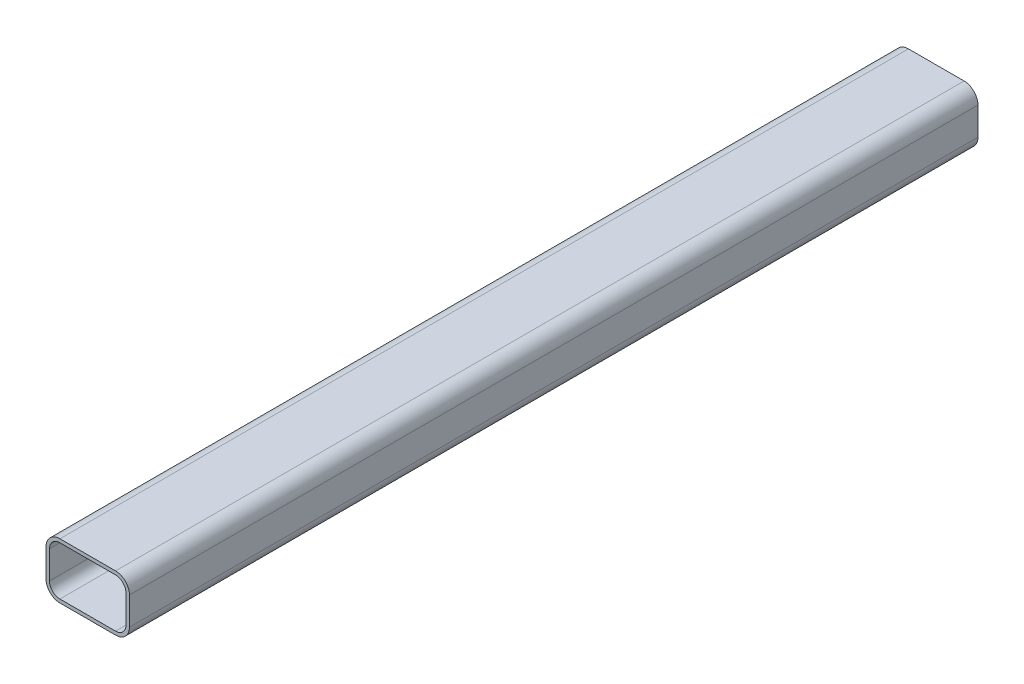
ISO-10303-21;
HEADER;
FILE_DESCRIPTION(('STEP AP214'),'2;1');
FILE_NAME('part.step','',(''),(''),'','','');
FILE_SCHEMA(('AUTOMOTIVE_DESIGN { 1 0 10303 214 1 1 1 1 }'));
ENDSEC;
DATA;
#1=APPLICATION_CONTEXT('core data for automotive mechanical design processes');
#2=APPLICATION_PROTOCOL_DEFINITION('international standard','automotive_design',2000,#1);
#3=PRODUCT_CONTEXT('',#1,'mechanical');
#4=PRODUCT('Part','Part','',(#3));
#5=PRODUCT_RELATED_PRODUCT_CATEGORY('part','',(#4));
#6=PRODUCT_DEFINITION_FORMATION('','',#4);
#7=PRODUCT_DEFINITION_CONTEXT('part definition',#1,'design');
#8=PRODUCT_DEFINITION('design','',#6,#7);
#9=PRODUCT_DEFINITION_SHAPE('','',#8);
#10=(LENGTH_UNIT() NAMED_UNIT(*) SI_UNIT(.MILLI.,.METRE.));
#11=(NAMED_UNIT(*) PLANE_ANGLE_UNIT() SI_UNIT($,.RADIAN.));
#12=(NAMED_UNIT(*) SI_UNIT($,.STERADIAN.) SOLID_ANGLE_UNIT());
#13=UNCERTAINTY_MEASURE_WITH_UNIT(LENGTH_MEASURE(1.E-05),#10,'distance_accuracy_value','');
#14=(GEOMETRIC_REPRESENTATION_CONTEXT(3) GLOBAL_UNCERTAINTY_ASSIGNED_CONTEXT((#13)) GLOBAL_UNIT_ASSIGNED_CONTEXT((#10,
#11,#12)) REPRESENTATION_CONTEXT('',''));
#15=CARTESIAN_POINT('',(0.,0.,0.));
#16=DIRECTION('',(0.,0.,1.));
#17=DIRECTION('',(1.,0.,0.));
#18=AXIS2_PLACEMENT_3D('',#15,#16,#17);
#19=CARTESIAN_POINT('',(-762.00000000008,-165.1,387.35));
#20=DIRECTION('',(0.,0.,1.));
#21=DIRECTION('',(1.,0.,0.));
#22=AXIS2_PLACEMENT_3D('',#19,#20,#21);
#23=PLANE('',#22);
#24=CARTESIAN_POINT('',(-762.00000000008,-165.1,387.35));
#25=DIRECTION('',(0.,0.,1.));
#26=DIRECTION('',(1.,0.,0.));
#27=AXIS2_PLACEMENT_3D('',#24,#25,#26);
#28=CIRCLE('',#27,12.7);
#29=CARTESIAN_POINT('',(-762.00000000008,-177.8,387.35));
#30=VERTEX_POINT('',#29);
#31=CARTESIAN_POINT('',(-749.30000000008,-165.1,387.35));
#32=VERTEX_POINT('',#31);
#33=EDGE_CURVE('E226',#30,#32,#28,.T.);
#34=ORIENTED_EDGE('',*,*,#33,.T.);
#35=DIRECTION('',(0.,-1.,0.));
#36=VECTOR('',#35,1.);
#37=CARTESIAN_POINT('',(-749.300000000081,-139.7,387.35));
#38=LINE('',#37,#36);
#39=CARTESIAN_POINT('',(-749.300000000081,-139.7,387.35));
#40=VERTEX_POINT('',#39);
#41=EDGE_CURVE('E228',#40,#32,#38,.T.);
#42=ORIENTED_EDGE('',*,*,#41,.F.);
#43=CARTESIAN_POINT('',(-762.00000000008,-139.7,387.35));
#44=DIRECTION('',(0.,0.,1.));
#45=DIRECTION('',(1.,0.,0.));
#46=AXIS2_PLACEMENT_3D('',#43,#44,#45);
#47=CIRCLE('',#46,12.7);
#48=CARTESIAN_POINT('',(-762.00000000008,-127.,387.35));
#49=VERTEX_POINT('',#48);
#50=EDGE_CURVE('E231',#40,#49,#47,.T.);
#51=ORIENTED_EDGE('',*,*,#50,.T.);
#52=DIRECTION('',(-1.,0.,0.));
#53=VECTOR('',#52,1.);
#54=CARTESIAN_POINT('',(-762.00000000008,-127.,387.35));
#55=LINE('',#54,#53);
#56=CARTESIAN_POINT('',(-812.80000000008,-127.,387.35));
#57=VERTEX_POINT('',#56);
#58=EDGE_CURVE('E233',#49,#57,#55,.T.);
#59=ORIENTED_EDGE('',*,*,#58,.T.);
#60=CARTESIAN_POINT('',(-812.80000000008,-139.7,387.35));
#61=DIRECTION('',(0.,0.,1.));
#62=DIRECTION('',(1.,0.,0.));
#63=AXIS2_PLACEMENT_3D('',#60,#61,#62);
#64=CIRCLE('',#63,12.7);
#65=CARTESIAN_POINT('',(-825.50000000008,-139.7,387.35));
#66=VERTEX_POINT('',#65);
#67=EDGE_CURVE('E235',#57,#66,#64,.T.);
#68=ORIENTED_EDGE('',*,*,#67,.T.);
#69=DIRECTION('',(0.,1.,0.));
#70=VECTOR('',#69,1.);
#71=CARTESIAN_POINT('',(-825.50000000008,-165.1,387.35));
#72=LINE('',#71,#70);
#73=CARTESIAN_POINT('',(-825.50000000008,-165.1,387.35));
#74=VERTEX_POINT('',#73);
#75=EDGE_CURVE('E237',#74,#66,#72,.T.);
#76=ORIENTED_EDGE('',*,*,#75,.F.);
#77=CARTESIAN_POINT('',(-812.80000000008,-165.1,387.35));
#78=DIRECTION('',(0.,0.,1.));
#79=DIRECTION('',(1.,0.,0.));
#80=AXIS2_PLACEMENT_3D('',#77,#78,#79);
#81=CIRCLE('',#80,12.7);
#82=CARTESIAN_POINT('',(-812.80000000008,-177.8,387.35));
#83=VERTEX_POINT('',#82);
#84=EDGE_CURVE('E240',#74,#83,#81,.T.);
#85=ORIENTED_EDGE('',*,*,#84,.T.);
#86=DIRECTION('',(1.,0.,0.));
#87=VECTOR('',#86,1.);
#88=CARTESIAN_POINT('',(-812.80000000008,-177.8,387.35));
#89=LINE('',#88,#87);
#90=EDGE_CURVE('E242',#83,#30,#89,.T.);
#91=ORIENTED_EDGE('',*,*,#90,.T.);
#92=EDGE_LOOP('',(#34,#42,#51,#59,#68,#76,#85,#91));
#93=FACE_BOUND('',#92,.T.);
#94=DIRECTION('',(0.,-1.,0.));
#95=VECTOR('',#94,1.);
#96=CARTESIAN_POINT('',(-752.475000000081,-139.7,387.35));
#97=LINE('',#96,#95);
#98=CARTESIAN_POINT('',(-752.475000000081,-139.7,387.35));
#99=VERTEX_POINT('',#98);
#100=CARTESIAN_POINT('',(-752.475000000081,-165.1,387.35));
#101=VERTEX_POINT('',#100);
#102=EDGE_CURVE('E180',#99,#101,#97,.T.);
#103=ORIENTED_EDGE('',*,*,#102,.T.);
#104=CARTESIAN_POINT('',(-762.00000000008,-165.1,387.35));
#105=DIRECTION('',(0.,0.,1.));
#106=DIRECTION('',(1.,0.,0.));
#107=AXIS2_PLACEMENT_3D('',#104,#105,#106);
#108=CIRCLE('',#107,9.52500000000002);
#109=CARTESIAN_POINT('',(-762.00000000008,-174.625,387.35));
#110=VERTEX_POINT('',#109);
#111=EDGE_CURVE('E145',#110,#101,#108,.T.);
#112=ORIENTED_EDGE('',*,*,#111,.F.);
#113=DIRECTION('',(1.,0.,0.));
#114=VECTOR('',#113,1.);
#115=CARTESIAN_POINT('',(-812.80000000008,-174.625,387.35));
#116=LINE('',#115,#114);
#117=CARTESIAN_POINT('',(-812.80000000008,-174.625,387.35));
#118=VERTEX_POINT('',#117);
#119=EDGE_CURVE('E193',#118,#110,#116,.T.);
#120=ORIENTED_EDGE('',*,*,#119,.F.);
#121=CARTESIAN_POINT('',(-812.80000000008,-165.1,387.35));
#122=DIRECTION('',(0.,0.,1.));
#123=DIRECTION('',(1.,0.,0.));
#124=AXIS2_PLACEMENT_3D('',#121,#122,#123);
#125=CIRCLE('',#124,9.52499999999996);
#126=CARTESIAN_POINT('',(-822.32500000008,-165.1,387.35));
#127=VERTEX_POINT('',#126);
#128=EDGE_CURVE('E191',#127,#118,#125,.T.);
#129=ORIENTED_EDGE('',*,*,#128,.F.);
#130=DIRECTION('',(0.,1.,0.));
#131=VECTOR('',#130,1.);
#132=CARTESIAN_POINT('',(-822.32500000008,-165.1,387.35));
#133=LINE('',#132,#131);
#134=CARTESIAN_POINT('',(-822.32500000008,-139.7,387.35));
#135=VERTEX_POINT('',#134);
#136=EDGE_CURVE('E188',#127,#135,#133,.T.);
#137=ORIENTED_EDGE('',*,*,#136,.T.);
#138=CARTESIAN_POINT('',(-812.80000000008,-139.7,387.35));
#139=DIRECTION('',(0.,0.,1.));
#140=DIRECTION('',(1.,0.,0.));
#141=AXIS2_PLACEMENT_3D('',#138,#139,#140);
#142=CIRCLE('',#141,9.52500000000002);
#143=CARTESIAN_POINT('',(-812.80000000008,-130.175,387.35));
#144=VERTEX_POINT('',#143);
#145=EDGE_CURVE('E186',#144,#135,#142,.T.);
#146=ORIENTED_EDGE('',*,*,#145,.F.);
#147=DIRECTION('',(-1.,0.,0.));
#148=VECTOR('',#147,1.);
#149=CARTESIAN_POINT('',(-762.00000000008,-130.175,387.35));
#150=LINE('',#149,#148);
#151=CARTESIAN_POINT('',(-762.00000000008,-130.175,387.35));
#152=VERTEX_POINT('',#151);
#153=EDGE_CURVE('E184',#152,#144,#150,.T.);
#154=ORIENTED_EDGE('',*,*,#153,.F.);
#155=CARTESIAN_POINT('',(-762.00000000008,-139.7,387.35));
#156=DIRECTION('',(0.,0.,1.));
#157=DIRECTION('',(1.,0.,0.));
#158=AXIS2_PLACEMENT_3D('',#155,#156,#157);
#159=CIRCLE('',#158,9.52500000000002);
#160=EDGE_CURVE('E182',#99,#152,#159,.T.);
#161=ORIENTED_EDGE('',*,*,#160,.F.);
#162=EDGE_LOOP('',(#103,#112,#120,#129,#137,#146,#154,#161));
#163=FACE_BOUND('',#162,.T.);
#164=ADVANCED_FACE('F30',(#93,#163),#23,.T.);
#165=CARTESIAN_POINT('',(-762.00000000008,-165.1,-387.35));
#166=DIRECTION('',(0.,0.,1.));
#167=DIRECTION('',(1.,0.,0.));
#168=AXIS2_PLACEMENT_3D('',#165,#166,#167);
#169=PLANE('',#168);
#170=CARTESIAN_POINT('',(-762.00000000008,-165.1,-387.35));
#171=DIRECTION('',(0.,0.,1.));
#172=DIRECTION('',(1.,0.,0.));
#173=AXIS2_PLACEMENT_3D('',#170,#171,#172);
#174=CIRCLE('',#173,12.7);
#175=CARTESIAN_POINT('',(-762.00000000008,-177.8,-387.35));
#176=VERTEX_POINT('',#175);
#177=CARTESIAN_POINT('',(-749.30000000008,-165.1,-387.35));
#178=VERTEX_POINT('',#177);
#179=EDGE_CURVE('E149',#176,#178,#174,.T.);
#180=ORIENTED_EDGE('',*,*,#179,.F.);
#181=DIRECTION('',(1.,0.,0.));
#182=VECTOR('',#181,1.);
#183=CARTESIAN_POINT('',(-812.80000000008,-177.8,-387.35));
#184=LINE('',#183,#182);
#185=CARTESIAN_POINT('',(-812.80000000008,-177.8,-387.35));
#186=VERTEX_POINT('',#185);
#187=EDGE_CURVE('E224',#186,#176,#184,.T.);
#188=ORIENTED_EDGE('',*,*,#187,.F.);
#189=CARTESIAN_POINT('',(-812.80000000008,-165.1,-387.35));
#190=DIRECTION('',(0.,0.,1.));
#191=DIRECTION('',(1.,0.,0.));
#192=AXIS2_PLACEMENT_3D('',#189,#190,#191);
#193=CIRCLE('',#192,12.7);
#194=CARTESIAN_POINT('',(-825.50000000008,-165.1,-387.35));
#195=VERTEX_POINT('',#194);
#196=EDGE_CURVE('E222',#195,#186,#193,.T.);
#197=ORIENTED_EDGE('',*,*,#196,.F.);
#198=DIRECTION('',(0.,1.,0.));
#199=VECTOR('',#198,1.);
#200=CARTESIAN_POINT('',(-825.50000000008,-165.1,-387.35));
#201=LINE('',#200,#199);
#202=CARTESIAN_POINT('',(-825.50000000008,-139.7,-387.35));
#203=VERTEX_POINT('',#202);
#204=EDGE_CURVE('E219',#195,#203,#201,.T.);
#205=ORIENTED_EDGE('',*,*,#204,.T.);
#206=CARTESIAN_POINT('',(-812.80000000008,-139.7,-387.35));
#207=DIRECTION('',(0.,0.,1.));
#208=DIRECTION('',(1.,0.,0.));
#209=AXIS2_PLACEMENT_3D('',#206,#207,#208);
#210=CIRCLE('',#209,12.7);
#211=CARTESIAN_POINT('',(-812.80000000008,-127.,-387.35));
#212=VERTEX_POINT('',#211);
#213=EDGE_CURVE('E216',#212,#203,#210,.T.);
#214=ORIENTED_EDGE('',*,*,#213,.F.);
#215=DIRECTION('',(-1.,0.,0.));
#216=VECTOR('',#215,1.);
#217=CARTESIAN_POINT('',(-762.00000000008,-127.,-387.35));
#218=LINE('',#217,#216);
#219=CARTESIAN_POINT('',(-762.00000000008,-127.,-387.35));
#220=VERTEX_POINT('',#219);
#221=EDGE_CURVE('E214',#220,#212,#218,.T.);
#222=ORIENTED_EDGE('',*,*,#221,.F.);
#223=CARTESIAN_POINT('',(-762.00000000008,-139.7,-387.35));
#224=DIRECTION('',(0.,0.,1.));
#225=DIRECTION('',(1.,0.,0.));
#226=AXIS2_PLACEMENT_3D('',#223,#224,#225);
#227=CIRCLE('',#226,12.7);
#228=CARTESIAN_POINT('',(-749.300000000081,-139.7,-387.35));
#229=VERTEX_POINT('',#228);
#230=EDGE_CURVE('E212',#229,#220,#227,.T.);
#231=ORIENTED_EDGE('',*,*,#230,.F.);
#232=DIRECTION('',(0.,-1.,0.));
#233=VECTOR('',#232,1.);
#234=CARTESIAN_POINT('',(-749.300000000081,-139.7,-387.35));
#235=LINE('',#234,#233);
#236=EDGE_CURVE('E209',#229,#178,#235,.T.);
#237=ORIENTED_EDGE('',*,*,#236,.T.);
#238=EDGE_LOOP('',(#180,#188,#197,#205,#214,#222,#231,#237));
#239=FACE_BOUND('',#238,.T.);
#240=CARTESIAN_POINT('',(-762.00000000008,-165.1,-387.35));
#241=DIRECTION('',(0.,0.,1.));
#242=DIRECTION('',(1.,0.,0.));
#243=AXIS2_PLACEMENT_3D('',#240,#241,#242);
#244=CIRCLE('',#243,9.52500000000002);
#245=CARTESIAN_POINT('',(-762.00000000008,-174.625,-387.35));
#246=VERTEX_POINT('',#245);
#247=CARTESIAN_POINT('',(-752.475000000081,-165.1,-387.35));
#248=VERTEX_POINT('',#247);
#249=EDGE_CURVE('E53',#246,#248,#244,.T.);
#250=ORIENTED_EDGE('',*,*,#249,.T.);
#251=DIRECTION('',(0.,-1.,0.));
#252=VECTOR('',#251,1.);
#253=CARTESIAN_POINT('',(-752.475000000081,-139.7,-387.35));
#254=LINE('',#253,#252);
#255=CARTESIAN_POINT('',(-752.475000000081,-139.7,-387.35));
#256=VERTEX_POINT('',#255);
#257=EDGE_CURVE('E153',#256,#248,#254,.T.);
#258=ORIENTED_EDGE('',*,*,#257,.F.);
#259=CARTESIAN_POINT('',(-762.00000000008,-139.7,-387.35));
#260=DIRECTION('',(0.,0.,1.));
#261=DIRECTION('',(1.,0.,0.));
#262=AXIS2_PLACEMENT_3D('',#259,#260,#261);
#263=CIRCLE('',#262,9.52500000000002);
#264=CARTESIAN_POINT('',(-762.00000000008,-130.175,-387.35));
#265=VERTEX_POINT('',#264);
#266=EDGE_CURVE('E158',#256,#265,#263,.T.);
#267=ORIENTED_EDGE('',*,*,#266,.T.);
#268=DIRECTION('',(-1.,0.,0.));
#269=VECTOR('',#268,1.);
#270=CARTESIAN_POINT('',(-762.00000000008,-130.175,-387.35));
#271=LINE('',#270,#269);
#272=CARTESIAN_POINT('',(-812.80000000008,-130.175,-387.35));
#273=VERTEX_POINT('',#272);
#274=EDGE_CURVE('E167',#265,#273,#271,.T.);
#275=ORIENTED_EDGE('',*,*,#274,.T.);
#276=CARTESIAN_POINT('',(-812.80000000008,-139.7,-387.35));
#277=DIRECTION('',(0.,0.,1.));
#278=DIRECTION('',(1.,0.,0.));
#279=AXIS2_PLACEMENT_3D('',#276,#277,#278);
#280=CIRCLE('',#279,9.52500000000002);
#281=CARTESIAN_POINT('',(-822.32500000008,-139.7,-387.35));
#282=VERTEX_POINT('',#281);
#283=EDGE_CURVE('E170',#273,#282,#280,.T.);
#284=ORIENTED_EDGE('',*,*,#283,.T.);
#285=DIRECTION('',(0.,1.,0.));
#286=VECTOR('',#285,1.);
#287=CARTESIAN_POINT('',(-822.32500000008,-165.1,-387.35));
#288=LINE('',#287,#286);
#289=CARTESIAN_POINT('',(-822.32500000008,-165.1,-387.35));
#290=VERTEX_POINT('',#289);
#291=EDGE_CURVE('E173',#290,#282,#288,.T.);
#292=ORIENTED_EDGE('',*,*,#291,.F.);
#293=CARTESIAN_POINT('',(-812.80000000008,-165.1,-387.35));
#294=DIRECTION('',(0.,0.,1.));
#295=DIRECTION('',(1.,0.,0.));
#296=AXIS2_PLACEMENT_3D('',#293,#294,#295);
#297=CIRCLE('',#296,9.52499999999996);
#298=CARTESIAN_POINT('',(-812.80000000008,-174.625,-387.35));
#299=VERTEX_POINT('',#298);
#300=EDGE_CURVE('E176',#290,#299,#297,.T.);
#301=ORIENTED_EDGE('',*,*,#300,.T.);
#302=DIRECTION('',(1.,0.,0.));
#303=VECTOR('',#302,1.);
#304=CARTESIAN_POINT('',(-812.80000000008,-174.625,-387.35));
#305=LINE('',#304,#303);
#306=EDGE_CURVE('E163',#299,#246,#305,.T.);
#307=ORIENTED_EDGE('',*,*,#306,.T.);
#308=EDGE_LOOP('',(#250,#258,#267,#275,#284,#292,#301,#307));
#309=FACE_BOUND('',#308,.T.);
#310=ADVANCED_FACE('F161',(#239,#309),#169,.F.);
#311=CARTESIAN_POINT('',(-762.00000000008,-165.1,387.35));
#312=DIRECTION('',(0.,0.,-1.));
#313=DIRECTION('',(-1.,0.,0.));
#314=AXIS2_PLACEMENT_3D('',#311,#312,#313);
#315=CYLINDRICAL_SURFACE('',#314,12.7);
#316=ORIENTED_EDGE('',*,*,#179,.T.);
#317=DIRECTION('',(0.,0.,-1.));
#318=VECTOR('',#317,1.);
#319=CARTESIAN_POINT('',(-749.30000000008,-165.1,387.35));
#320=LINE('',#319,#318);
#321=EDGE_CURVE('E11',#32,#178,#320,.T.);
#322=ORIENTED_EDGE('',*,*,#321,.F.);
#323=ORIENTED_EDGE('',*,*,#33,.F.);
#324=DIRECTION('',(0.,0.,-1.));
#325=VECTOR('',#324,1.);
#326=CARTESIAN_POINT('',(-762.00000000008,-177.8,387.35));
#327=LINE('',#326,#325);
#328=EDGE_CURVE('E244',#30,#176,#327,.T.);
#329=ORIENTED_EDGE('',*,*,#328,.T.);
#330=EDGE_LOOP('',(#316,#322,#323,#329));
#331=FACE_BOUND('',#330,.T.);
#332=ADVANCED_FACE('F32',(#331),#315,.T.);
#333=CARTESIAN_POINT('',(-749.300000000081,-139.7,387.35));
#334=DIRECTION('',(1.,0.,0.));
#335=DIRECTION('',(0.,1.,0.));
#336=AXIS2_PLACEMENT_3D('',#333,#334,#335);
#337=PLANE('',#336);
#338=ORIENTED_EDGE('',*,*,#236,.F.);
#339=DIRECTION('',(0.,0.,-1.));
#340=VECTOR('',#339,1.);
#341=CARTESIAN_POINT('',(-749.300000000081,-139.7,387.35));
#342=LINE('',#341,#340);
#343=EDGE_CURVE('E38',#40,#229,#342,.T.);
#344=ORIENTED_EDGE('',*,*,#343,.F.);
#345=ORIENTED_EDGE('',*,*,#41,.T.);
#346=ORIENTED_EDGE('',*,*,#321,.T.);
#347=EDGE_LOOP('',(#338,#344,#345,#346));
#348=FACE_BOUND('',#347,.T.);
#349=ADVANCED_FACE('F271',(#348),#337,.T.);
#350=CARTESIAN_POINT('',(-762.00000000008,-139.7,387.35));
#351=DIRECTION('',(0.,0.,-1.));
#352=DIRECTION('',(-1.,0.,0.));
#353=AXIS2_PLACEMENT_3D('',#350,#351,#352);
#354=CYLINDRICAL_SURFACE('',#353,12.7);
#355=ORIENTED_EDGE('',*,*,#230,.T.);
#356=DIRECTION('',(0.,0.,-1.));
#357=VECTOR('',#356,1.);
#358=CARTESIAN_POINT('',(-762.00000000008,-127.,387.35));
#359=LINE('',#358,#357);
#360=EDGE_CURVE('E257',#49,#220,#359,.T.);
#361=ORIENTED_EDGE('',*,*,#360,.F.);
#362=ORIENTED_EDGE('',*,*,#50,.F.);
#363=ORIENTED_EDGE('',*,*,#343,.T.);
#364=EDGE_LOOP('',(#355,#361,#362,#363));
#365=FACE_BOUND('',#364,.T.);
#366=ADVANCED_FACE('F262',(#365),#354,.T.);
#367=CARTESIAN_POINT('',(-762.00000000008,-127.,387.35));
#368=DIRECTION('',(0.,-1.,0.));
#369=DIRECTION('',(0.,0.,-1.));
#370=AXIS2_PLACEMENT_3D('',#367,#368,#369);
#371=PLANE('',#370);
#372=ORIENTED_EDGE('',*,*,#221,.T.);
#373=DIRECTION('',(0.,0.,-1.));
#374=VECTOR('',#373,1.);
#375=CARTESIAN_POINT('',(-812.80000000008,-127.,387.35));
#376=LINE('',#375,#374);
#377=EDGE_CURVE('E254',#57,#212,#376,.T.);
#378=ORIENTED_EDGE('',*,*,#377,.F.);
#379=ORIENTED_EDGE('',*,*,#58,.F.);
#380=ORIENTED_EDGE('',*,*,#360,.T.);
#381=EDGE_LOOP('',(#372,#378,#379,#380));
#382=FACE_BOUND('',#381,.T.);
#383=ADVANCED_FACE('F296',(#382),#371,.F.);
#384=CARTESIAN_POINT('',(-812.80000000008,-139.7,387.35));
#385=DIRECTION('',(0.,0.,-1.));
#386=DIRECTION('',(-1.,0.,0.));
#387=AXIS2_PLACEMENT_3D('',#384,#385,#386);
#388=CYLINDRICAL_SURFACE('',#387,12.7);
#389=ORIENTED_EDGE('',*,*,#213,.T.);
#390=DIRECTION('',(0.,0.,-1.));
#391=VECTOR('',#390,1.);
#392=CARTESIAN_POINT('',(-825.50000000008,-139.7,387.35));
#393=LINE('',#392,#391);
#394=EDGE_CURVE('E252',#66,#203,#393,.T.);
#395=ORIENTED_EDGE('',*,*,#394,.F.);
#396=ORIENTED_EDGE('',*,*,#67,.F.);
#397=ORIENTED_EDGE('',*,*,#377,.T.);
#398=EDGE_LOOP('',(#389,#395,#396,#397));
#399=FACE_BOUND('',#398,.T.);
#400=ADVANCED_FACE('F291',(#399),#388,.T.);
#401=CARTESIAN_POINT('',(-825.50000000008,-165.1,387.35));
#402=DIRECTION('',(-1.,0.,0.));
#403=DIRECTION('',(0.,0.,1.));
#404=AXIS2_PLACEMENT_3D('',#401,#402,#403);
#405=PLANE('',#404);
#406=ORIENTED_EDGE('',*,*,#204,.F.);
#407=DIRECTION('',(0.,0.,-1.));
#408=VECTOR('',#407,1.);
#409=CARTESIAN_POINT('',(-825.50000000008,-165.1,387.35));
#410=LINE('',#409,#408);
#411=EDGE_CURVE('E250',#74,#195,#410,.T.);
#412=ORIENTED_EDGE('',*,*,#411,.F.);
#413=ORIENTED_EDGE('',*,*,#75,.T.);
#414=ORIENTED_EDGE('',*,*,#394,.T.);
#415=EDGE_LOOP('',(#406,#412,#413,#414));
#416=FACE_BOUND('',#415,.T.);
#417=ADVANCED_FACE('F288',(#416),#405,.T.);
#418=CARTESIAN_POINT('',(-812.80000000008,-165.1,387.35));
#419=DIRECTION('',(0.,0.,-1.));
#420=DIRECTION('',(-1.,0.,0.));
#421=AXIS2_PLACEMENT_3D('',#418,#419,#420);
#422=CYLINDRICAL_SURFACE('',#421,12.7);
#423=ORIENTED_EDGE('',*,*,#196,.T.);
#424=DIRECTION('',(0.,0.,-1.));
#425=VECTOR('',#424,1.);
#426=CARTESIAN_POINT('',(-812.80000000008,-177.8,387.35));
#427=LINE('',#426,#425);
#428=EDGE_CURVE('E247',#83,#186,#427,.T.);
#429=ORIENTED_EDGE('',*,*,#428,.F.);
#430=ORIENTED_EDGE('',*,*,#84,.F.);
#431=ORIENTED_EDGE('',*,*,#411,.T.);
#432=EDGE_LOOP('',(#423,#429,#430,#431));
#433=FACE_BOUND('',#432,.T.);
#434=ADVANCED_FACE('F285',(#433),#422,.T.);
#435=CARTESIAN_POINT('',(-812.80000000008,-177.8,387.35));
#436=DIRECTION('',(0.,1.,0.));
#437=DIRECTION('',(0.,0.,1.));
#438=AXIS2_PLACEMENT_3D('',#435,#436,#437);
#439=PLANE('',#438);
#440=ORIENTED_EDGE('',*,*,#187,.T.);
#441=ORIENTED_EDGE('',*,*,#328,.F.);
#442=ORIENTED_EDGE('',*,*,#90,.F.);
#443=ORIENTED_EDGE('',*,*,#428,.T.);
#444=EDGE_LOOP('',(#440,#441,#442,#443));
#445=FACE_BOUND('',#444,.T.);
#446=ADVANCED_FACE('F280',(#445),#439,.F.);
#447=CARTESIAN_POINT('',(-762.00000000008,-165.1,387.35));
#448=DIRECTION('',(0.,0.,-1.));
#449=DIRECTION('',(-1.,0.,0.));
#450=AXIS2_PLACEMENT_3D('',#447,#448,#449);
#451=CYLINDRICAL_SURFACE('',#450,9.52500000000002);
#452=ORIENTED_EDGE('',*,*,#249,.F.);
#453=DIRECTION('',(0.,0.,-1.));
#454=VECTOR('',#453,1.);
#455=CARTESIAN_POINT('',(-762.00000000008,-174.625,387.35));
#456=LINE('',#455,#454);
#457=EDGE_CURVE('E195',#110,#246,#456,.T.);
#458=ORIENTED_EDGE('',*,*,#457,.F.);
#459=ORIENTED_EDGE('',*,*,#111,.T.);
#460=DIRECTION('',(0.,0.,-1.));
#461=VECTOR('',#460,1.);
#462=CARTESIAN_POINT('',(-752.475000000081,-165.1,387.35));
#463=LINE('',#462,#461);
#464=EDGE_CURVE('E141',#101,#248,#463,.T.);
#465=ORIENTED_EDGE('',*,*,#464,.T.);
#466=EDGE_LOOP('',(#452,#458,#459,#465));
#467=FACE_BOUND('',#466,.T.);
#468=ADVANCED_FACE('F143',(#467),#451,.F.);
#469=CARTESIAN_POINT('',(-752.475000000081,-139.7,387.35));
#470=DIRECTION('',(1.,0.,0.));
#471=DIRECTION('',(0.,1.,0.));
#472=AXIS2_PLACEMENT_3D('',#469,#470,#471);
#473=PLANE('',#472);
#474=ORIENTED_EDGE('',*,*,#257,.T.);
#475=ORIENTED_EDGE('',*,*,#464,.F.);
#476=ORIENTED_EDGE('',*,*,#102,.F.);
#477=DIRECTION('',(0.,0.,-1.));
#478=VECTOR('',#477,1.);
#479=CARTESIAN_POINT('',(-752.475000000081,-139.7,387.35));
#480=LINE('',#479,#478);
#481=EDGE_CURVE('E150',#99,#256,#480,.T.);
#482=ORIENTED_EDGE('',*,*,#481,.T.);
#483=EDGE_LOOP('',(#474,#475,#476,#482));
#484=FACE_BOUND('',#483,.T.);
#485=ADVANCED_FACE('F154',(#484),#473,.F.);
#486=CARTESIAN_POINT('',(-762.00000000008,-139.7,387.35));
#487=DIRECTION('',(0.,0.,-1.));
#488=DIRECTION('',(-1.,0.,0.));
#489=AXIS2_PLACEMENT_3D('',#486,#487,#488);
#490=CYLINDRICAL_SURFACE('',#489,9.52500000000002);
#491=ORIENTED_EDGE('',*,*,#266,.F.);
#492=ORIENTED_EDGE('',*,*,#481,.F.);
#493=ORIENTED_EDGE('',*,*,#160,.T.);
#494=DIRECTION('',(0.,0.,-1.));
#495=VECTOR('',#494,1.);
#496=CARTESIAN_POINT('',(-762.00000000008,-130.175,387.35));
#497=LINE('',#496,#495);
#498=EDGE_CURVE('E204',#152,#265,#497,.T.);
#499=ORIENTED_EDGE('',*,*,#498,.T.);
#500=EDGE_LOOP('',(#491,#492,#493,#499));
#501=FACE_BOUND('',#500,.T.);
#502=ADVANCED_FACE('F307',(#501),#490,.F.);
#503=CARTESIAN_POINT('',(-762.00000000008,-130.175,387.35));
#504=DIRECTION('',(0.,-1.,0.));
#505=DIRECTION('',(0.,0.,-1.));
#506=AXIS2_PLACEMENT_3D('',#503,#504,#505);
#507=PLANE('',#506);
#508=ORIENTED_EDGE('',*,*,#274,.F.);
#509=ORIENTED_EDGE('',*,*,#498,.F.);
#510=ORIENTED_EDGE('',*,*,#153,.T.);
#511=DIRECTION('',(0.,0.,-1.));
#512=VECTOR('',#511,1.);
#513=CARTESIAN_POINT('',(-812.80000000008,-130.175,387.35));
#514=LINE('',#513,#512);
#515=EDGE_CURVE('E202',#144,#273,#514,.T.);
#516=ORIENTED_EDGE('',*,*,#515,.T.);
#517=EDGE_LOOP('',(#508,#509,#510,#516));
#518=FACE_BOUND('',#517,.T.);
#519=ADVANCED_FACE('F310',(#518),#507,.T.);
#520=CARTESIAN_POINT('',(-812.80000000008,-139.7,387.35));
#521=DIRECTION('',(0.,0.,-1.));
#522=DIRECTION('',(-1.,0.,0.));
#523=AXIS2_PLACEMENT_3D('',#520,#521,#522);
#524=CYLINDRICAL_SURFACE('',#523,9.52500000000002);
#525=ORIENTED_EDGE('',*,*,#283,.F.);
#526=ORIENTED_EDGE('',*,*,#515,.F.);
#527=ORIENTED_EDGE('',*,*,#145,.T.);
#528=DIRECTION('',(0.,0.,-1.));
#529=VECTOR('',#528,1.);
#530=CARTESIAN_POINT('',(-822.32500000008,-139.7,387.35));
#531=LINE('',#530,#529);
#532=EDGE_CURVE('E200',#135,#282,#531,.T.);
#533=ORIENTED_EDGE('',*,*,#532,.T.);
#534=EDGE_LOOP('',(#525,#526,#527,#533));
#535=FACE_BOUND('',#534,.T.);
#536=ADVANCED_FACE('F315',(#535),#524,.F.);
#537=CARTESIAN_POINT('',(-822.32500000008,-165.1,387.35));
#538=DIRECTION('',(-1.,0.,0.));
#539=DIRECTION('',(0.,0.,1.));
#540=AXIS2_PLACEMENT_3D('',#537,#538,#539);
#541=PLANE('',#540);
#542=ORIENTED_EDGE('',*,*,#291,.T.);
#543=ORIENTED_EDGE('',*,*,#532,.F.);
#544=ORIENTED_EDGE('',*,*,#136,.F.);
#545=DIRECTION('',(0.,0.,-1.));
#546=VECTOR('',#545,1.);
#547=CARTESIAN_POINT('',(-822.32500000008,-165.1,387.35));
#548=LINE('',#547,#546);
#549=EDGE_CURVE('E198',#127,#290,#548,.T.);
#550=ORIENTED_EDGE('',*,*,#549,.T.);
#551=EDGE_LOOP('',(#542,#543,#544,#550));
#552=FACE_BOUND('',#551,.T.);
#553=ADVANCED_FACE('F319',(#552),#541,.F.);
#554=CARTESIAN_POINT('',(-812.80000000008,-165.1,387.35));
#555=DIRECTION('',(0.,0.,-1.));
#556=DIRECTION('',(-1.,0.,0.));
#557=AXIS2_PLACEMENT_3D('',#554,#555,#556);
#558=CYLINDRICAL_SURFACE('',#557,9.52499999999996);
#559=ORIENTED_EDGE('',*,*,#300,.F.);
#560=ORIENTED_EDGE('',*,*,#549,.F.);
#561=ORIENTED_EDGE('',*,*,#128,.T.);
#562=DIRECTION('',(0.,0.,-1.));
#563=VECTOR('',#562,1.);
#564=CARTESIAN_POINT('',(-812.80000000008,-174.625,387.35));
#565=LINE('',#564,#563);
#566=EDGE_CURVE('E45',#118,#299,#565,.T.);
#567=ORIENTED_EDGE('',*,*,#566,.T.);
#568=EDGE_LOOP('',(#559,#560,#561,#567));
#569=FACE_BOUND('',#568,.T.);
#570=ADVANCED_FACE('F323',(#569),#558,.F.);
#571=CARTESIAN_POINT('',(-812.80000000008,-174.625,387.35));
#572=DIRECTION('',(0.,1.,0.));
#573=DIRECTION('',(0.,0.,1.));
#574=AXIS2_PLACEMENT_3D('',#571,#572,#573);
#575=PLANE('',#574);
#576=ORIENTED_EDGE('',*,*,#306,.F.);
#577=ORIENTED_EDGE('',*,*,#566,.F.);
#578=ORIENTED_EDGE('',*,*,#119,.T.);
#579=ORIENTED_EDGE('',*,*,#457,.T.);
#580=EDGE_LOOP('',(#576,#577,#578,#579));
#581=FACE_BOUND('',#580,.T.);
#582=ADVANCED_FACE('F324',(#581),#575,.T.);
#583=CLOSED_SHELL('',(#164,#310,#332,#349,#366,#383,#400,#417,#434,#446,#468,#485,#502,#519,
#536,#553,#570,#582));
#584=MANIFOLD_SOLID_BREP('B2',#583);
#585=ADVANCED_BREP_SHAPE_REPRESENTATION('',(#18,#584),#14);
#586=SHAPE_DEFINITION_REPRESENTATION(#9,#585);
ENDSEC;
END-ISO-10303-21;
